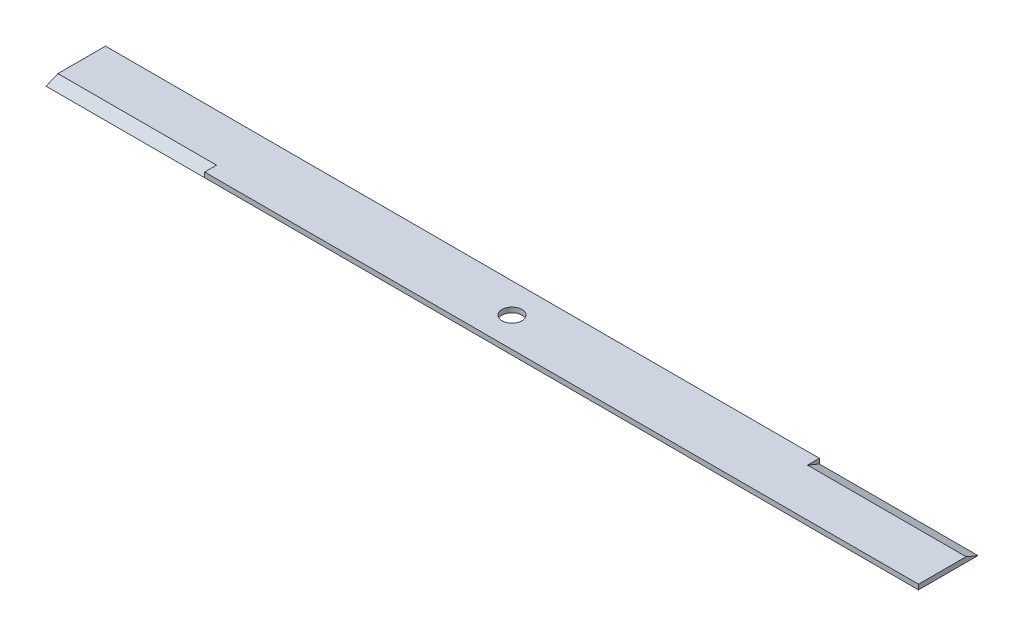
from build123d import *

# Parameters (mm, degrees)
SKETCH2_W            = 558.8
SKETCH2_H            = 38.1
SKETCH2_R            = 6.35
MOWER_BLADE_DEPTH    = 3.175
CUTTING_EDGE_1_DEPTH = 101.6
CUTTING_EDGE_2_DEPTH = 101.6


with BuildPart() as part:
    # Sketch2 → Mower Blade (new body)
    with BuildSketch(Plane(origin=(0, 0, 0), x_dir=(1, 0, 0), z_dir=(0, 1, 0))):
        Rectangle(SKETCH2_W, SKETCH2_H)
        with Locations(Location((0, 0, 0), (0, 0, 270))):
            Circle(SKETCH2_R, mode=Mode.SUBTRACT)
    extrude(amount=MOWER_BLADE_DEPTH)

    # Sketch3 → Cutting Edge _1 (cut)
    with BuildSketch(Plane(origin=(279.4, 0, 0), x_dir=(0, 0, -1), z_dir=(1, 0, 0))):
        Polygon((19.05, 0), (11.43, 3.175), (19.05, 3.175), align=None)
    extrude(amount=-CUTTING_EDGE_1_DEPTH, mode=Mode.SUBTRACT)

    # Sketch4 → Cutting Edge _2 (cut)
    with BuildSketch(Plane.ZY.offset(279.4)):
        Polygon((19.05, 0), (11.43, 3.175), (19.05, 3.175), align=None)
    extrude(amount=-CUTTING_EDGE_2_DEPTH, mode=Mode.SUBTRACT)


solid = part.part
